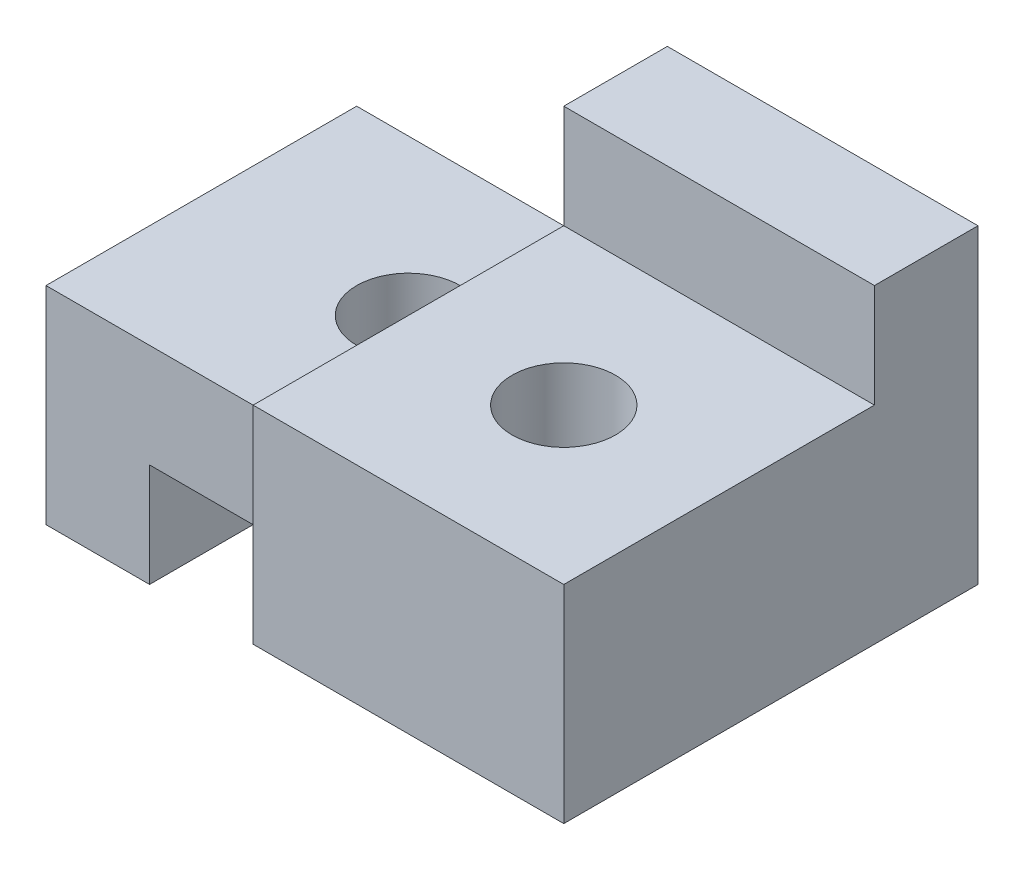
ISO-10303-21;
HEADER;
FILE_DESCRIPTION(('STEP AP214'),'2;1');
FILE_NAME('part.step','',(''),(''),'','','');
FILE_SCHEMA(('AUTOMOTIVE_DESIGN { 1 0 10303 214 1 1 1 1 }'));
ENDSEC;
DATA;
#1=APPLICATION_CONTEXT('core data for automotive mechanical design processes');
#2=APPLICATION_PROTOCOL_DEFINITION('international standard','automotive_design',2000,#1);
#3=PRODUCT_CONTEXT('',#1,'mechanical');
#4=PRODUCT('Part','Part','',(#3));
#5=PRODUCT_RELATED_PRODUCT_CATEGORY('part','',(#4));
#6=PRODUCT_DEFINITION_FORMATION('','',#4);
#7=PRODUCT_DEFINITION_CONTEXT('part definition',#1,'design');
#8=PRODUCT_DEFINITION('design','',#6,#7);
#9=PRODUCT_DEFINITION_SHAPE('','',#8);
#10=(LENGTH_UNIT() NAMED_UNIT(*) SI_UNIT(.MILLI.,.METRE.));
#11=(NAMED_UNIT(*) PLANE_ANGLE_UNIT() SI_UNIT($,.RADIAN.));
#12=(NAMED_UNIT(*) SI_UNIT($,.STERADIAN.) SOLID_ANGLE_UNIT());
#13=UNCERTAINTY_MEASURE_WITH_UNIT(LENGTH_MEASURE(1.E-05),#10,'distance_accuracy_value','');
#14=(GEOMETRIC_REPRESENTATION_CONTEXT(3) GLOBAL_UNCERTAINTY_ASSIGNED_CONTEXT((#13)) GLOBAL_UNIT_ASSIGNED_CONTEXT((#10,
#11,#12)) REPRESENTATION_CONTEXT('',''));
#15=CARTESIAN_POINT('',(0.,0.,0.));
#16=DIRECTION('',(0.,0.,1.));
#17=DIRECTION('',(1.,0.,0.));
#18=AXIS2_PLACEMENT_3D('',#15,#16,#17);
#19=CARTESIAN_POINT('',(0.,50.8,76.2));
#20=DIRECTION('',(0.,-1.,0.));
#21=DIRECTION('',(1.,0.,0.));
#22=AXIS2_PLACEMENT_3D('',#19,#20,#21);
#23=PLANE('',#22);
#24=CARTESIAN_POINT('',(50.8,50.8,38.1));
#25=DIRECTION('',(0.,1.,0.));
#26=DIRECTION('',(-1.,0.,0.));
#27=AXIS2_PLACEMENT_3D('',#24,#25,#26);
#28=CIRCLE('',#27,12.7);
#29=CARTESIAN_POINT('',(38.1,50.8,38.1));
#30=VERTEX_POINT('',#29);
#31=EDGE_CURVE('E211',#30,#30,#28,.T.);
#32=ORIENTED_EDGE('',*,*,#31,.F.);
#33=EDGE_LOOP('',(#32));
#34=FACE_BOUND('',#33,.T.);
#35=DIRECTION('',(-1.,0.,0.));
#36=VECTOR('',#35,1.);
#37=CARTESIAN_POINT('',(0.,50.8,0.));
#38=LINE('',#37,#36);
#39=CARTESIAN_POINT('',(76.2,50.8,0.));
#40=VERTEX_POINT('',#39);
#41=CARTESIAN_POINT('',(0.,50.8,0.));
#42=VERTEX_POINT('',#41);
#43=EDGE_CURVE('E132',#40,#42,#38,.T.);
#44=ORIENTED_EDGE('',*,*,#43,.T.);
#45=DIRECTION('',(0.,0.,-1.));
#46=VECTOR('',#45,1.);
#47=CARTESIAN_POINT('',(0.,50.8,76.2));
#48=LINE('',#47,#46);
#49=CARTESIAN_POINT('',(0.,50.8,76.2));
#50=VERTEX_POINT('',#49);
#51=EDGE_CURVE('E52',#50,#42,#48,.T.);
#52=ORIENTED_EDGE('',*,*,#51,.F.);
#53=DIRECTION('',(-1.,0.,0.));
#54=VECTOR('',#53,1.);
#55=CARTESIAN_POINT('',(0.,50.8,76.2));
#56=LINE('',#55,#54);
#57=CARTESIAN_POINT('',(76.2,50.8,76.2));
#58=VERTEX_POINT('',#57);
#59=EDGE_CURVE('E99',#58,#50,#56,.T.);
#60=ORIENTED_EDGE('',*,*,#59,.F.);
#61=DIRECTION('',(0.,0.,-1.));
#62=VECTOR('',#61,1.);
#63=CARTESIAN_POINT('',(76.2,50.8,76.2));
#64=LINE('',#63,#62);
#65=EDGE_CURVE('E11',#58,#40,#64,.T.);
#66=ORIENTED_EDGE('',*,*,#65,.T.);
#67=EDGE_LOOP('',(#44,#52,#60,#66));
#68=FACE_BOUND('',#67,.T.);
#69=ADVANCED_FACE('F45',(#34,#68),#23,.F.);
#70=CARTESIAN_POINT('',(0.,0.,76.2));
#71=DIRECTION('',(1.,0.,0.));
#72=DIRECTION('',(0.,0.,-1.));
#73=AXIS2_PLACEMENT_3D('',#70,#71,#72);
#74=PLANE('',#73);
#75=DIRECTION('',(0.,-1.,0.));
#76=VECTOR('',#75,1.);
#77=CARTESIAN_POINT('',(0.,0.,0.));
#78=LINE('',#77,#76);
#79=CARTESIAN_POINT('',(0.,0.,0.));
#80=VERTEX_POINT('',#79);
#81=EDGE_CURVE('E119',#42,#80,#78,.T.);
#82=ORIENTED_EDGE('',*,*,#81,.T.);
#83=DIRECTION('',(0.,0.,-1.));
#84=VECTOR('',#83,1.);
#85=CARTESIAN_POINT('',(0.,0.,76.2));
#86=LINE('',#85,#84);
#87=CARTESIAN_POINT('',(0.,0.,76.2));
#88=VERTEX_POINT('',#87);
#89=EDGE_CURVE('E116',#88,#80,#86,.T.);
#90=ORIENTED_EDGE('',*,*,#89,.F.);
#91=DIRECTION('',(0.,-1.,0.));
#92=VECTOR('',#91,1.);
#93=CARTESIAN_POINT('',(0.,0.,76.2));
#94=LINE('',#93,#92);
#95=EDGE_CURVE('E106',#50,#88,#94,.T.);
#96=ORIENTED_EDGE('',*,*,#95,.F.);
#97=ORIENTED_EDGE('',*,*,#51,.T.);
#98=EDGE_LOOP('',(#82,#90,#96,#97));
#99=FACE_BOUND('',#98,.T.);
#100=ADVANCED_FACE('F117',(#99),#74,.F.);
#101=CARTESIAN_POINT('',(0.,0.,76.2));
#102=DIRECTION('',(0.,1.,0.));
#103=DIRECTION('',(0.,0.,1.));
#104=AXIS2_PLACEMENT_3D('',#101,#102,#103);
#105=PLANE('',#104);
#106=DIRECTION('',(1.,0.,0.));
#107=VECTOR('',#106,1.);
#108=CARTESIAN_POINT('',(0.,0.,0.));
#109=LINE('',#108,#107);
#110=CARTESIAN_POINT('',(25.4,0.,0.));
#111=VERTEX_POINT('',#110);
#112=EDGE_CURVE('E136',#80,#111,#109,.T.);
#113=ORIENTED_EDGE('',*,*,#112,.T.);
#114=DIRECTION('',(0.,0.,-1.));
#115=VECTOR('',#114,1.);
#116=CARTESIAN_POINT('',(25.4,0.,76.2));
#117=LINE('',#116,#115);
#118=CARTESIAN_POINT('',(25.4,0.,76.2));
#119=VERTEX_POINT('',#118);
#120=EDGE_CURVE('E122',#119,#111,#117,.T.);
#121=ORIENTED_EDGE('',*,*,#120,.F.);
#122=DIRECTION('',(1.,0.,0.));
#123=VECTOR('',#122,1.);
#124=CARTESIAN_POINT('',(0.,0.,76.2));
#125=LINE('',#124,#123);
#126=EDGE_CURVE('E110',#88,#119,#125,.T.);
#127=ORIENTED_EDGE('',*,*,#126,.F.);
#128=ORIENTED_EDGE('',*,*,#89,.T.);
#129=EDGE_LOOP('',(#113,#121,#127,#128));
#130=FACE_BOUND('',#129,.T.);
#131=ADVANCED_FACE('F124',(#130),#105,.F.);
#132=CARTESIAN_POINT('',(25.4,0.,76.2));
#133=DIRECTION('',(-1.,0.,0.));
#134=DIRECTION('',(0.,0.,1.));
#135=AXIS2_PLACEMENT_3D('',#132,#133,#134);
#136=PLANE('',#135);
#137=DIRECTION('',(0.,1.,0.));
#138=VECTOR('',#137,1.);
#139=CARTESIAN_POINT('',(25.4,0.,0.));
#140=LINE('',#139,#138);
#141=CARTESIAN_POINT('',(25.4,25.4,0.));
#142=VERTEX_POINT('',#141);
#143=EDGE_CURVE('E91',#111,#142,#140,.T.);
#144=ORIENTED_EDGE('',*,*,#143,.T.);
#145=DIRECTION('',(0.,0.,-1.));
#146=VECTOR('',#145,1.);
#147=CARTESIAN_POINT('',(25.4,25.4,76.2));
#148=LINE('',#147,#146);
#149=CARTESIAN_POINT('',(25.4,25.4,76.2));
#150=VERTEX_POINT('',#149);
#151=EDGE_CURVE('E131',#150,#142,#148,.T.);
#152=ORIENTED_EDGE('',*,*,#151,.F.);
#153=DIRECTION('',(0.,1.,0.));
#154=VECTOR('',#153,1.);
#155=CARTESIAN_POINT('',(25.4,0.,76.2));
#156=LINE('',#155,#154);
#157=EDGE_CURVE('E68',#119,#150,#156,.T.);
#158=ORIENTED_EDGE('',*,*,#157,.F.);
#159=ORIENTED_EDGE('',*,*,#120,.T.);
#160=EDGE_LOOP('',(#144,#152,#158,#159));
#161=FACE_BOUND('',#160,.T.);
#162=ADVANCED_FACE('F150',(#161),#136,.F.);
#163=CARTESIAN_POINT('',(0.,25.4,76.2));
#164=DIRECTION('',(0.,1.,0.));
#165=DIRECTION('',(0.,0.,1.));
#166=AXIS2_PLACEMENT_3D('',#163,#164,#165);
#167=PLANE('',#166);
#168=CARTESIAN_POINT('',(114.3,25.4,63.5));
#169=DIRECTION('',(0.,1.,0.));
#170=DIRECTION('',(0.,0.,1.));
#171=AXIS2_PLACEMENT_3D('',#168,#169,#170);
#172=CIRCLE('',#171,12.7);
#173=CARTESIAN_POINT('',(114.3,25.4,76.2));
#174=VERTEX_POINT('',#173);
#175=EDGE_CURVE('E214',#174,#174,#172,.T.);
#176=ORIENTED_EDGE('',*,*,#175,.T.);
#177=EDGE_LOOP('',(#176));
#178=FACE_BOUND('',#177,.T.);
#179=CARTESIAN_POINT('',(50.8,25.4,38.1));
#180=DIRECTION('',(0.,1.,0.));
#181=DIRECTION('',(-1.,0.,0.));
#182=AXIS2_PLACEMENT_3D('',#179,#180,#181);
#183=CIRCLE('',#182,12.7);
#184=CARTESIAN_POINT('',(38.1,25.4,38.1));
#185=VERTEX_POINT('',#184);
#186=EDGE_CURVE('E202',#185,#185,#183,.T.);
#187=ORIENTED_EDGE('',*,*,#186,.T.);
#188=EDGE_LOOP('',(#187));
#189=FACE_BOUND('',#188,.T.);
#190=DIRECTION('',(1.,0.,0.));
#191=VECTOR('',#190,1.);
#192=CARTESIAN_POINT('',(0.,25.4,0.));
#193=LINE('',#192,#191);
#194=CARTESIAN_POINT('',(152.4,25.4,0.));
#195=VERTEX_POINT('',#194);
#196=EDGE_CURVE('E139',#142,#195,#193,.T.);
#197=ORIENTED_EDGE('',*,*,#196,.T.);
#198=DIRECTION('',(0.,0.,-1.));
#199=VECTOR('',#198,1.);
#200=CARTESIAN_POINT('',(152.4,25.4,101.6));
#201=LINE('',#200,#199);
#202=CARTESIAN_POINT('',(152.4,25.4,101.6));
#203=VERTEX_POINT('',#202);
#204=EDGE_CURVE('E169',#203,#195,#201,.T.);
#205=ORIENTED_EDGE('',*,*,#204,.F.);
#206=DIRECTION('',(1.,0.,0.));
#207=VECTOR('',#206,1.);
#208=CARTESIAN_POINT('',(0.,25.4,101.6));
#209=LINE('',#208,#207);
#210=CARTESIAN_POINT('',(76.2,25.4,101.6));
#211=VERTEX_POINT('',#210);
#212=EDGE_CURVE('E184',#211,#203,#209,.T.);
#213=ORIENTED_EDGE('',*,*,#212,.F.);
#214=DIRECTION('',(0.,0.,-1.));
#215=VECTOR('',#214,1.);
#216=CARTESIAN_POINT('',(76.2,25.4,101.6));
#217=LINE('',#216,#215);
#218=CARTESIAN_POINT('',(76.2,25.4,76.2));
#219=VERTEX_POINT('',#218);
#220=EDGE_CURVE('E157',#211,#219,#217,.T.);
#221=ORIENTED_EDGE('',*,*,#220,.T.);
#222=DIRECTION('',(1.,0.,0.));
#223=VECTOR('',#222,1.);
#224=CARTESIAN_POINT('',(0.,25.4,76.2));
#225=LINE('',#224,#223);
#226=EDGE_CURVE('E126',#150,#219,#225,.T.);
#227=ORIENTED_EDGE('',*,*,#226,.F.);
#228=ORIENTED_EDGE('',*,*,#151,.T.);
#229=EDGE_LOOP('',(#197,#205,#213,#221,#227,#228));
#230=FACE_BOUND('',#229,.T.);
#231=ADVANCED_FACE('F154',(#178,#189,#230),#167,.F.);
#232=CARTESIAN_POINT('',(0.,0.,76.2));
#233=DIRECTION('',(0.,0.,1.));
#234=DIRECTION('',(1.,0.,0.));
#235=AXIS2_PLACEMENT_3D('',#232,#233,#234);
#236=PLANE('',#235);
#237=DIRECTION('',(0.,-1.,0.));
#238=VECTOR('',#237,1.);
#239=CARTESIAN_POINT('',(76.2,0.,76.2));
#240=LINE('',#239,#238);
#241=EDGE_CURVE('E142',#58,#219,#240,.T.);
#242=ORIENTED_EDGE('',*,*,#241,.F.);
#243=ORIENTED_EDGE('',*,*,#59,.T.);
#244=ORIENTED_EDGE('',*,*,#95,.T.);
#245=ORIENTED_EDGE('',*,*,#126,.T.);
#246=ORIENTED_EDGE('',*,*,#157,.T.);
#247=ORIENTED_EDGE('',*,*,#226,.T.);
#248=EDGE_LOOP('',(#242,#243,#244,#245,#246,#247));
#249=FACE_BOUND('',#248,.T.);
#250=ADVANCED_FACE('F108',(#249),#236,.T.);
#251=CARTESIAN_POINT('',(0.,0.,0.));
#252=DIRECTION('',(0.,0.,1.));
#253=DIRECTION('',(1.,0.,0.));
#254=AXIS2_PLACEMENT_3D('',#251,#252,#253);
#255=PLANE('',#254);
#256=ORIENTED_EDGE('',*,*,#43,.F.);
#257=DIRECTION('',(0.,-1.,0.));
#258=VECTOR('',#257,1.);
#259=CARTESIAN_POINT('',(76.2,0.,0.));
#260=LINE('',#259,#258);
#261=CARTESIAN_POINT('',(76.2,101.6,0.));
#262=VERTEX_POINT('',#261);
#263=EDGE_CURVE('E179',#262,#40,#260,.T.);
#264=ORIENTED_EDGE('',*,*,#263,.F.);
#265=DIRECTION('',(-1.,0.,0.));
#266=VECTOR('',#265,1.);
#267=CARTESIAN_POINT('',(0.,101.6,0.));
#268=LINE('',#267,#266);
#269=CARTESIAN_POINT('',(152.4,101.6,0.));
#270=VERTEX_POINT('',#269);
#271=EDGE_CURVE('E198',#270,#262,#268,.T.);
#272=ORIENTED_EDGE('',*,*,#271,.F.);
#273=DIRECTION('',(0.,1.,0.));
#274=VECTOR('',#273,1.);
#275=CARTESIAN_POINT('',(152.4,0.,0.));
#276=LINE('',#275,#274);
#277=EDGE_CURVE('E175',#195,#270,#276,.T.);
#278=ORIENTED_EDGE('',*,*,#277,.F.);
#279=ORIENTED_EDGE('',*,*,#196,.F.);
#280=ORIENTED_EDGE('',*,*,#143,.F.);
#281=ORIENTED_EDGE('',*,*,#112,.F.);
#282=ORIENTED_EDGE('',*,*,#81,.F.);
#283=EDGE_LOOP('',(#256,#264,#272,#278,#279,#280,#281,#282));
#284=FACE_BOUND('',#283,.T.);
#285=ADVANCED_FACE('F146',(#284),#255,.F.);
#286=CARTESIAN_POINT('',(0.,76.2,101.6));
#287=DIRECTION('',(0.,1.,0.));
#288=DIRECTION('',(0.,0.,1.));
#289=AXIS2_PLACEMENT_3D('',#286,#287,#288);
#290=PLANE('',#289);
#291=CARTESIAN_POINT('',(114.3,76.2,63.5));
#292=DIRECTION('',(0.,1.,0.));
#293=DIRECTION('',(0.,0.,1.));
#294=AXIS2_PLACEMENT_3D('',#291,#292,#293);
#295=CIRCLE('',#294,12.7);
#296=CARTESIAN_POINT('',(114.3,76.2,76.2));
#297=VERTEX_POINT('',#296);
#298=EDGE_CURVE('E217',#297,#297,#295,.T.);
#299=ORIENTED_EDGE('',*,*,#298,.F.);
#300=EDGE_LOOP('',(#299));
#301=FACE_BOUND('',#300,.T.);
#302=DIRECTION('',(1.,0.,0.));
#303=VECTOR('',#302,1.);
#304=CARTESIAN_POINT('',(0.,76.2,25.4));
#305=LINE('',#304,#303);
#306=CARTESIAN_POINT('',(76.2,76.2,25.4));
#307=VERTEX_POINT('',#306);
#308=CARTESIAN_POINT('',(152.4,76.2,25.4));
#309=VERTEX_POINT('',#308);
#310=EDGE_CURVE('E59',#307,#309,#305,.T.);
#311=ORIENTED_EDGE('',*,*,#310,.F.);
#312=DIRECTION('',(0.,0.,-1.));
#313=VECTOR('',#312,1.);
#314=CARTESIAN_POINT('',(76.2,76.2,101.6));
#315=LINE('',#314,#313);
#316=CARTESIAN_POINT('',(76.2,76.2,101.6));
#317=VERTEX_POINT('',#316);
#318=EDGE_CURVE('E134',#317,#307,#315,.T.);
#319=ORIENTED_EDGE('',*,*,#318,.F.);
#320=DIRECTION('',(1.,0.,0.));
#321=VECTOR('',#320,1.);
#322=CARTESIAN_POINT('',(0.,76.2,101.6));
#323=LINE('',#322,#321);
#324=CARTESIAN_POINT('',(152.4,76.2,101.6));
#325=VERTEX_POINT('',#324);
#326=EDGE_CURVE('E178',#317,#325,#323,.T.);
#327=ORIENTED_EDGE('',*,*,#326,.T.);
#328=DIRECTION('',(0.,0.,-1.));
#329=VECTOR('',#328,1.);
#330=CARTESIAN_POINT('',(152.4,76.2,101.6));
#331=LINE('',#330,#329);
#332=EDGE_CURVE('E172',#325,#309,#331,.T.);
#333=ORIENTED_EDGE('',*,*,#332,.T.);
#334=EDGE_LOOP('',(#311,#319,#327,#333));
#335=FACE_BOUND('',#334,.T.);
#336=ADVANCED_FACE('F232',(#301,#335),#290,.T.);
#337=CARTESIAN_POINT('',(76.2,0.,101.6));
#338=DIRECTION('',(1.,0.,0.));
#339=DIRECTION('',(0.,0.,-1.));
#340=AXIS2_PLACEMENT_3D('',#337,#338,#339);
#341=PLANE('',#340);
#342=ORIENTED_EDGE('',*,*,#65,.F.);
#343=ORIENTED_EDGE('',*,*,#241,.T.);
#344=ORIENTED_EDGE('',*,*,#220,.F.);
#345=DIRECTION('',(0.,-1.,0.));
#346=VECTOR('',#345,1.);
#347=CARTESIAN_POINT('',(76.2,0.,101.6));
#348=LINE('',#347,#346);
#349=EDGE_CURVE('E187',#317,#211,#348,.T.);
#350=ORIENTED_EDGE('',*,*,#349,.F.);
#351=ORIENTED_EDGE('',*,*,#318,.T.);
#352=DIRECTION('',(0.,-1.,0.));
#353=VECTOR('',#352,1.);
#354=CARTESIAN_POINT('',(76.2,0.,25.4));
#355=LINE('',#354,#353);
#356=CARTESIAN_POINT('',(76.2,101.6,25.4));
#357=VERTEX_POINT('',#356);
#358=EDGE_CURVE('E201',#357,#307,#355,.T.);
#359=ORIENTED_EDGE('',*,*,#358,.F.);
#360=DIRECTION('',(0.,0.,-1.));
#361=VECTOR('',#360,1.);
#362=CARTESIAN_POINT('',(76.2,101.6,25.4));
#363=LINE('',#362,#361);
#364=EDGE_CURVE('E194',#357,#262,#363,.T.);
#365=ORIENTED_EDGE('',*,*,#364,.T.);
#366=ORIENTED_EDGE('',*,*,#263,.T.);
#367=EDGE_LOOP('',(#342,#343,#344,#350,#351,#359,#365,#366));
#368=FACE_BOUND('',#367,.T.);
#369=ADVANCED_FACE('F162',(#368),#341,.F.);
#370=CARTESIAN_POINT('',(152.4,0.,101.6));
#371=DIRECTION('',(-1.,0.,0.));
#372=DIRECTION('',(0.,-1.,0.));
#373=AXIS2_PLACEMENT_3D('',#370,#371,#372);
#374=PLANE('',#373);
#375=ORIENTED_EDGE('',*,*,#277,.T.);
#376=DIRECTION('',(0.,0.,-1.));
#377=VECTOR('',#376,1.);
#378=CARTESIAN_POINT('',(152.4,101.6,25.4));
#379=LINE('',#378,#377);
#380=CARTESIAN_POINT('',(152.4,101.6,25.4));
#381=VERTEX_POINT('',#380);
#382=EDGE_CURVE('E181',#381,#270,#379,.T.);
#383=ORIENTED_EDGE('',*,*,#382,.F.);
#384=DIRECTION('',(0.,1.,0.));
#385=VECTOR('',#384,1.);
#386=CARTESIAN_POINT('',(152.4,0.,25.4));
#387=LINE('',#386,#385);
#388=EDGE_CURVE('E205',#309,#381,#387,.T.);
#389=ORIENTED_EDGE('',*,*,#388,.F.);
#390=ORIENTED_EDGE('',*,*,#332,.F.);
#391=DIRECTION('',(0.,1.,0.));
#392=VECTOR('',#391,1.);
#393=CARTESIAN_POINT('',(152.4,0.,101.6));
#394=LINE('',#393,#392);
#395=EDGE_CURVE('E174',#203,#325,#394,.T.);
#396=ORIENTED_EDGE('',*,*,#395,.F.);
#397=ORIENTED_EDGE('',*,*,#204,.T.);
#398=EDGE_LOOP('',(#375,#383,#389,#390,#396,#397));
#399=FACE_BOUND('',#398,.T.);
#400=ADVANCED_FACE('F239',(#399),#374,.F.);
#401=CARTESIAN_POINT('',(0.,0.,101.6));
#402=DIRECTION('',(0.,0.,1.));
#403=DIRECTION('',(1.,0.,0.));
#404=AXIS2_PLACEMENT_3D('',#401,#402,#403);
#405=PLANE('',#404);
#406=ORIENTED_EDGE('',*,*,#326,.F.);
#407=ORIENTED_EDGE('',*,*,#349,.T.);
#408=ORIENTED_EDGE('',*,*,#212,.T.);
#409=ORIENTED_EDGE('',*,*,#395,.T.);
#410=EDGE_LOOP('',(#406,#407,#408,#409));
#411=FACE_BOUND('',#410,.T.);
#412=ADVANCED_FACE('F265',(#411),#405,.T.);
#413=CARTESIAN_POINT('',(0.,101.6,25.4));
#414=DIRECTION('',(0.,-1.,0.));
#415=DIRECTION('',(1.,0.,0.));
#416=AXIS2_PLACEMENT_3D('',#413,#414,#415);
#417=PLANE('',#416);
#418=ORIENTED_EDGE('',*,*,#271,.T.);
#419=ORIENTED_EDGE('',*,*,#364,.F.);
#420=DIRECTION('',(-1.,0.,0.));
#421=VECTOR('',#420,1.);
#422=CARTESIAN_POINT('',(0.,101.6,25.4));
#423=LINE('',#422,#421);
#424=EDGE_CURVE('E197',#381,#357,#423,.T.);
#425=ORIENTED_EDGE('',*,*,#424,.F.);
#426=ORIENTED_EDGE('',*,*,#382,.T.);
#427=EDGE_LOOP('',(#418,#419,#425,#426));
#428=FACE_BOUND('',#427,.T.);
#429=ADVANCED_FACE('F258',(#428),#417,.F.);
#430=CARTESIAN_POINT('',(0.,0.,25.4));
#431=DIRECTION('',(0.,0.,1.));
#432=DIRECTION('',(1.,0.,0.));
#433=AXIS2_PLACEMENT_3D('',#430,#431,#432);
#434=PLANE('',#433);
#435=ORIENTED_EDGE('',*,*,#358,.T.);
#436=ORIENTED_EDGE('',*,*,#310,.T.);
#437=ORIENTED_EDGE('',*,*,#388,.T.);
#438=ORIENTED_EDGE('',*,*,#424,.T.);
#439=EDGE_LOOP('',(#435,#436,#437,#438));
#440=FACE_BOUND('',#439,.T.);
#441=ADVANCED_FACE('F253',(#440),#434,.T.);
#442=CARTESIAN_POINT('',(50.8,25.4,38.1));
#443=DIRECTION('',(0.,1.,0.));
#444=DIRECTION('',(-1.,0.,0.));
#445=AXIS2_PLACEMENT_3D('',#442,#443,#444);
#446=CYLINDRICAL_SURFACE('',#445,12.7);
#447=ORIENTED_EDGE('',*,*,#186,.F.);
#448=EDGE_LOOP('',(#447));
#449=FACE_BOUND('',#448,.T.);
#450=ORIENTED_EDGE('',*,*,#31,.T.);
#451=EDGE_LOOP('',(#450));
#452=FACE_BOUND('',#451,.T.);
#453=ADVANCED_FACE('F228',(#449,#452),#446,.F.);
#454=CARTESIAN_POINT('',(114.3,25.4,63.5));
#455=DIRECTION('',(0.,1.,0.));
#456=DIRECTION('',(0.,0.,1.));
#457=AXIS2_PLACEMENT_3D('',#454,#455,#456);
#458=CYLINDRICAL_SURFACE('',#457,12.7);
#459=ORIENTED_EDGE('',*,*,#175,.F.);
#460=EDGE_LOOP('',(#459));
#461=FACE_BOUND('',#460,.T.);
#462=ORIENTED_EDGE('',*,*,#298,.T.);
#463=EDGE_LOOP('',(#462));
#464=FACE_BOUND('',#463,.T.);
#465=ADVANCED_FACE('F225',(#461,#464),#458,.F.);
#466=CLOSED_SHELL('',(#69,#100,#131,#162,#231,#250,#285,#336,#369,#400,#412,#429,#441,#453,#465));
#467=MANIFOLD_SOLID_BREP('B2',#466);
#468=ADVANCED_BREP_SHAPE_REPRESENTATION('',(#18,#467),#14);
#469=SHAPE_DEFINITION_REPRESENTATION(#9,#468);
ENDSEC;
END-ISO-10303-21;
